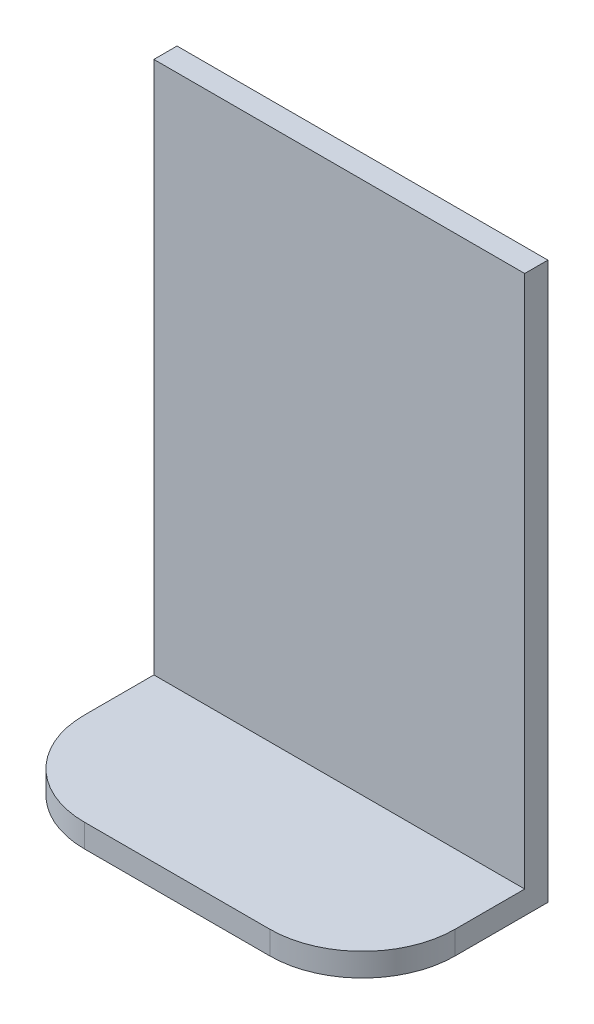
ISO-10303-21;
HEADER;
FILE_DESCRIPTION(('STEP AP214'),'2;1');
FILE_NAME('part.step','',(''),(''),'','','');
FILE_SCHEMA(('AUTOMOTIVE_DESIGN { 1 0 10303 214 1 1 1 1 }'));
ENDSEC;
DATA;
#1=APPLICATION_CONTEXT('core data for automotive mechanical design processes');
#2=APPLICATION_PROTOCOL_DEFINITION('international standard','automotive_design',2000,#1);
#3=PRODUCT_CONTEXT('',#1,'mechanical');
#4=PRODUCT('Part','Part','',(#3));
#5=PRODUCT_RELATED_PRODUCT_CATEGORY('part','',(#4));
#6=PRODUCT_DEFINITION_FORMATION('','',#4);
#7=PRODUCT_DEFINITION_CONTEXT('part definition',#1,'design');
#8=PRODUCT_DEFINITION('design','',#6,#7);
#9=PRODUCT_DEFINITION_SHAPE('','',#8);
#10=(LENGTH_UNIT() NAMED_UNIT(*) SI_UNIT(.MILLI.,.METRE.));
#11=(NAMED_UNIT(*) PLANE_ANGLE_UNIT() SI_UNIT($,.RADIAN.));
#12=(NAMED_UNIT(*) SI_UNIT($,.STERADIAN.) SOLID_ANGLE_UNIT());
#13=UNCERTAINTY_MEASURE_WITH_UNIT(LENGTH_MEASURE(1.E-05),#10,'distance_accuracy_value','');
#14=(GEOMETRIC_REPRESENTATION_CONTEXT(3) GLOBAL_UNCERTAINTY_ASSIGNED_CONTEXT((#13)) GLOBAL_UNIT_ASSIGNED_CONTEXT((#10,
#11,#12)) REPRESENTATION_CONTEXT('',''));
#15=CARTESIAN_POINT('',(0.,0.,0.));
#16=DIRECTION('',(0.,0.,1.));
#17=DIRECTION('',(1.,0.,0.));
#18=AXIS2_PLACEMENT_3D('',#15,#16,#17);
#19=CARTESIAN_POINT('',(25.4,76.2,0.));
#20=DIRECTION('',(0.,0.,1.));
#21=DIRECTION('',(0.,-1.,0.));
#22=AXIS2_PLACEMENT_3D('',#19,#20,#21);
#23=PLANE('',#22);
#24=DIRECTION('',(0.,1.,0.));
#25=VECTOR('',#24,1.);
#26=CARTESIAN_POINT('',(-25.4,76.2,0.));
#27=LINE('',#26,#25);
#28=CARTESIAN_POINT('',(-25.4,0.,0.));
#29=VERTEX_POINT('',#28);
#30=CARTESIAN_POINT('',(-25.4,76.2,0.));
#31=VERTEX_POINT('',#30);
#32=EDGE_CURVE('E128',#29,#31,#27,.T.);
#33=ORIENTED_EDGE('',*,*,#32,.T.);
#34=DIRECTION('',(-1.,0.,0.));
#35=VECTOR('',#34,1.);
#36=CARTESIAN_POINT('',(25.4,76.2,0.));
#37=LINE('',#36,#35);
#38=CARTESIAN_POINT('',(25.4,76.2,0.));
#39=VERTEX_POINT('',#38);
#40=EDGE_CURVE('E107',#39,#31,#37,.T.);
#41=ORIENTED_EDGE('',*,*,#40,.F.);
#42=DIRECTION('',(0.,1.,0.));
#43=VECTOR('',#42,1.);
#44=CARTESIAN_POINT('',(25.4,76.2,0.));
#45=LINE('',#44,#43);
#46=CARTESIAN_POINT('',(25.4,0.,0.));
#47=VERTEX_POINT('',#46);
#48=EDGE_CURVE('E114',#47,#39,#45,.T.);
#49=ORIENTED_EDGE('',*,*,#48,.F.);
#50=DIRECTION('',(-1.,0.,0.));
#51=VECTOR('',#50,1.);
#52=CARTESIAN_POINT('',(25.4,0.,0.));
#53=LINE('',#52,#51);
#54=EDGE_CURVE('E165',#47,#29,#53,.T.);
#55=ORIENTED_EDGE('',*,*,#54,.T.);
#56=EDGE_LOOP('',(#33,#41,#49,#55));
#57=FACE_BOUND('',#56,.T.);
#58=ADVANCED_FACE('F37',(#57),#23,.F.);
#59=CARTESIAN_POINT('',(25.4,76.2,3.17499999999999));
#60=DIRECTION('',(0.,-1.,0.));
#61=DIRECTION('',(0.,0.,-1.));
#62=AXIS2_PLACEMENT_3D('',#59,#60,#61);
#63=PLANE('',#62);
#64=DIRECTION('',(0.,0.,1.));
#65=VECTOR('',#64,1.);
#66=CARTESIAN_POINT('',(-25.4,76.2,3.17499999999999));
#67=LINE('',#66,#65);
#68=CARTESIAN_POINT('',(-25.4,76.2,3.17499999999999));
#69=VERTEX_POINT('',#68);
#70=EDGE_CURVE('E176',#31,#69,#67,.T.);
#71=ORIENTED_EDGE('',*,*,#70,.T.);
#72=DIRECTION('',(-1.,0.,0.));
#73=VECTOR('',#72,1.);
#74=CARTESIAN_POINT('',(25.4,76.2,3.17499999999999));
#75=LINE('',#74,#73);
#76=CARTESIAN_POINT('',(25.4,76.2,3.17499999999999));
#77=VERTEX_POINT('',#76);
#78=EDGE_CURVE('E110',#77,#69,#75,.T.);
#79=ORIENTED_EDGE('',*,*,#78,.F.);
#80=DIRECTION('',(0.,0.,1.));
#81=VECTOR('',#80,1.);
#82=CARTESIAN_POINT('',(25.4,76.2,3.17499999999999));
#83=LINE('',#82,#81);
#84=EDGE_CURVE('E103',#39,#77,#83,.T.);
#85=ORIENTED_EDGE('',*,*,#84,.F.);
#86=ORIENTED_EDGE('',*,*,#40,.T.);
#87=EDGE_LOOP('',(#71,#79,#85,#86));
#88=FACE_BOUND('',#87,.T.);
#89=ADVANCED_FACE('F105',(#88),#63,.F.);
#90=CARTESIAN_POINT('',(25.4,3.175,3.17499999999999));
#91=DIRECTION('',(0.,0.,-1.));
#92=DIRECTION('',(0.,1.,0.));
#93=AXIS2_PLACEMENT_3D('',#90,#91,#92);
#94=PLANE('',#93);
#95=DIRECTION('',(0.,-1.,0.));
#96=VECTOR('',#95,1.);
#97=CARTESIAN_POINT('',(-25.4,3.175,3.17499999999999));
#98=LINE('',#97,#96);
#99=CARTESIAN_POINT('',(-25.4,3.175,3.17499999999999));
#100=VERTEX_POINT('',#99);
#101=EDGE_CURVE('E174',#69,#100,#98,.T.);
#102=ORIENTED_EDGE('',*,*,#101,.T.);
#103=DIRECTION('',(-1.,0.,0.));
#104=VECTOR('',#103,1.);
#105=CARTESIAN_POINT('',(25.4,3.175,3.17499999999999));
#106=LINE('',#105,#104);
#107=CARTESIAN_POINT('',(25.4,3.175,3.17499999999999));
#108=VERTEX_POINT('',#107);
#109=EDGE_CURVE('E133',#108,#100,#106,.T.);
#110=ORIENTED_EDGE('',*,*,#109,.F.);
#111=DIRECTION('',(0.,-1.,0.));
#112=VECTOR('',#111,1.);
#113=CARTESIAN_POINT('',(25.4,3.175,3.17499999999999));
#114=LINE('',#113,#112);
#115=EDGE_CURVE('E113',#77,#108,#114,.T.);
#116=ORIENTED_EDGE('',*,*,#115,.F.);
#117=ORIENTED_EDGE('',*,*,#78,.T.);
#118=EDGE_LOOP('',(#102,#110,#116,#117));
#119=FACE_BOUND('',#118,.T.);
#120=ADVANCED_FACE('F182',(#119),#94,.F.);
#121=CARTESIAN_POINT('',(25.4,3.175,25.4));
#122=DIRECTION('',(0.,-1.,0.));
#123=DIRECTION('',(0.,0.,-1.));
#124=AXIS2_PLACEMENT_3D('',#121,#122,#123);
#125=PLANE('',#124);
#126=DIRECTION('',(-1.,0.,0.));
#127=VECTOR('',#126,1.);
#128=CARTESIAN_POINT('',(25.4,3.175,25.4));
#129=LINE('',#128,#127);
#130=CARTESIAN_POINT('',(12.7,3.175,25.4));
#131=VERTEX_POINT('',#130);
#132=CARTESIAN_POINT('',(-12.7,3.175,25.4));
#133=VERTEX_POINT('',#132);
#134=EDGE_CURVE('E150',#131,#133,#129,.T.);
#135=ORIENTED_EDGE('',*,*,#134,.F.);
#136=CARTESIAN_POINT('',(12.7,3.175,12.7));
#137=DIRECTION('',(0.,-1.,0.));
#138=DIRECTION('',(0.,0.,-1.));
#139=AXIS2_PLACEMENT_3D('',#136,#137,#138);
#140=CIRCLE('',#139,12.7);
#141=CARTESIAN_POINT('',(25.4,3.175,12.7));
#142=VERTEX_POINT('',#141);
#143=EDGE_CURVE('E45',#131,#142,#140,.F.);
#144=ORIENTED_EDGE('',*,*,#143,.T.);
#145=DIRECTION('',(0.,0.,1.));
#146=VECTOR('',#145,1.);
#147=CARTESIAN_POINT('',(25.4,3.175,25.4));
#148=LINE('',#147,#146);
#149=EDGE_CURVE('E149',#108,#142,#148,.T.);
#150=ORIENTED_EDGE('',*,*,#149,.F.);
#151=ORIENTED_EDGE('',*,*,#109,.T.);
#152=DIRECTION('',(0.,0.,1.));
#153=VECTOR('',#152,1.);
#154=CARTESIAN_POINT('',(-25.4,3.175,25.4));
#155=LINE('',#154,#153);
#156=CARTESIAN_POINT('',(-25.4,3.175,12.7));
#157=VERTEX_POINT('',#156);
#158=EDGE_CURVE('E170',#100,#157,#155,.T.);
#159=ORIENTED_EDGE('',*,*,#158,.T.);
#160=CARTESIAN_POINT('',(-12.7,3.175,12.7));
#161=DIRECTION('',(0.,-1.,0.));
#162=DIRECTION('',(0.,0.,-1.));
#163=AXIS2_PLACEMENT_3D('',#160,#161,#162);
#164=CIRCLE('',#163,12.7);
#165=EDGE_CURVE('E57',#157,#133,#164,.F.);
#166=ORIENTED_EDGE('',*,*,#165,.T.);
#167=EDGE_LOOP('',(#135,#144,#150,#151,#159,#166));
#168=FACE_BOUND('',#167,.T.);
#169=ADVANCED_FACE('F147',(#168),#125,.F.);
#170=CARTESIAN_POINT('',(25.4,0.,25.4));
#171=DIRECTION('',(0.,0.,-1.));
#172=DIRECTION('',(-1.,0.,0.));
#173=AXIS2_PLACEMENT_3D('',#170,#171,#172);
#174=PLANE('',#173);
#175=DIRECTION('',(-1.,0.,0.));
#176=VECTOR('',#175,1.);
#177=CARTESIAN_POINT('',(25.4,0.,25.4));
#178=LINE('',#177,#176);
#179=CARTESIAN_POINT('',(12.7,0.,25.4));
#180=VERTEX_POINT('',#179);
#181=CARTESIAN_POINT('',(-12.7,0.,25.4));
#182=VERTEX_POINT('',#181);
#183=EDGE_CURVE('E161',#180,#182,#178,.T.);
#184=ORIENTED_EDGE('',*,*,#183,.F.);
#185=DIRECTION('',(0.,-1.,0.));
#186=VECTOR('',#185,1.);
#187=CARTESIAN_POINT('',(12.7,0.,25.4));
#188=LINE('',#187,#186);
#189=EDGE_CURVE('E143',#180,#131,#188,.F.);
#190=ORIENTED_EDGE('',*,*,#189,.T.);
#191=ORIENTED_EDGE('',*,*,#134,.T.);
#192=DIRECTION('',(0.,-1.,0.));
#193=VECTOR('',#192,1.);
#194=CARTESIAN_POINT('',(-12.7,0.,25.4));
#195=LINE('',#194,#193);
#196=EDGE_CURVE('E140',#133,#182,#195,.T.);
#197=ORIENTED_EDGE('',*,*,#196,.T.);
#198=EDGE_LOOP('',(#184,#190,#191,#197));
#199=FACE_BOUND('',#198,.T.);
#200=ADVANCED_FACE('F163',(#199),#174,.F.);
#201=CARTESIAN_POINT('',(25.4,0.,0.));
#202=DIRECTION('',(0.,1.,0.));
#203=DIRECTION('',(0.,0.,1.));
#204=AXIS2_PLACEMENT_3D('',#201,#202,#203);
#205=PLANE('',#204);
#206=DIRECTION('',(0.,0.,-1.));
#207=VECTOR('',#206,1.);
#208=CARTESIAN_POINT('',(25.4,0.,0.));
#209=LINE('',#208,#207);
#210=CARTESIAN_POINT('',(25.4,0.,12.7));
#211=VERTEX_POINT('',#210);
#212=EDGE_CURVE('E121',#211,#47,#209,.T.);
#213=ORIENTED_EDGE('',*,*,#212,.F.);
#214=CARTESIAN_POINT('',(12.7,0.,12.7));
#215=DIRECTION('',(0.,1.,0.));
#216=DIRECTION('',(0.,0.,1.));
#217=AXIS2_PLACEMENT_3D('',#214,#215,#216);
#218=CIRCLE('',#217,12.7);
#219=EDGE_CURVE('E138',#211,#180,#218,.F.);
#220=ORIENTED_EDGE('',*,*,#219,.T.);
#221=ORIENTED_EDGE('',*,*,#183,.T.);
#222=CARTESIAN_POINT('',(-12.7,0.,12.7));
#223=DIRECTION('',(0.,1.,0.));
#224=DIRECTION('',(0.,0.,1.));
#225=AXIS2_PLACEMENT_3D('',#222,#223,#224);
#226=CIRCLE('',#225,12.7);
#227=CARTESIAN_POINT('',(-25.4,0.,12.7));
#228=VERTEX_POINT('',#227);
#229=EDGE_CURVE('E131',#182,#228,#226,.F.);
#230=ORIENTED_EDGE('',*,*,#229,.T.);
#231=DIRECTION('',(0.,0.,-1.));
#232=VECTOR('',#231,1.);
#233=CARTESIAN_POINT('',(-25.4,0.,0.));
#234=LINE('',#233,#232);
#235=EDGE_CURVE('E125',#228,#29,#234,.T.);
#236=ORIENTED_EDGE('',*,*,#235,.T.);
#237=ORIENTED_EDGE('',*,*,#54,.F.);
#238=EDGE_LOOP('',(#213,#220,#221,#230,#236,#237));
#239=FACE_BOUND('',#238,.T.);
#240=ADVANCED_FACE('F160',(#239),#205,.F.);
#241=CARTESIAN_POINT('',(25.4,0.,0.));
#242=DIRECTION('',(-1.,0.,0.));
#243=DIRECTION('',(0.,0.,1.));
#244=AXIS2_PLACEMENT_3D('',#241,#242,#243);
#245=PLANE('',#244);
#246=ORIENTED_EDGE('',*,*,#149,.T.);
#247=DIRECTION('',(0.,-1.,0.));
#248=VECTOR('',#247,1.);
#249=CARTESIAN_POINT('',(25.4,0.,12.7));
#250=LINE('',#249,#248);
#251=EDGE_CURVE('E129',#142,#211,#250,.T.);
#252=ORIENTED_EDGE('',*,*,#251,.T.);
#253=ORIENTED_EDGE('',*,*,#212,.T.);
#254=ORIENTED_EDGE('',*,*,#48,.T.);
#255=ORIENTED_EDGE('',*,*,#84,.T.);
#256=ORIENTED_EDGE('',*,*,#115,.T.);
#257=EDGE_LOOP('',(#246,#252,#253,#254,#255,#256));
#258=FACE_BOUND('',#257,.T.);
#259=ADVANCED_FACE('F118',(#258),#245,.F.);
#260=CARTESIAN_POINT('',(-25.4,0.,0.));
#261=DIRECTION('',(-1.,0.,0.));
#262=DIRECTION('',(0.,0.,1.));
#263=AXIS2_PLACEMENT_3D('',#260,#261,#262);
#264=PLANE('',#263);
#265=ORIENTED_EDGE('',*,*,#235,.F.);
#266=DIRECTION('',(0.,-1.,0.));
#267=VECTOR('',#266,1.);
#268=CARTESIAN_POINT('',(-25.4,3.175,12.7));
#269=LINE('',#268,#267);
#270=EDGE_CURVE('E11',#228,#157,#269,.F.);
#271=ORIENTED_EDGE('',*,*,#270,.T.);
#272=ORIENTED_EDGE('',*,*,#158,.F.);
#273=ORIENTED_EDGE('',*,*,#101,.F.);
#274=ORIENTED_EDGE('',*,*,#70,.F.);
#275=ORIENTED_EDGE('',*,*,#32,.F.);
#276=EDGE_LOOP('',(#265,#271,#272,#273,#274,#275));
#277=FACE_BOUND('',#276,.T.);
#278=ADVANCED_FACE('F173',(#277),#264,.T.);
#279=CARTESIAN_POINT('',(12.7,0.,12.7));
#280=DIRECTION('',(0.,-1.,0.));
#281=DIRECTION('',(0.,0.,-1.));
#282=AXIS2_PLACEMENT_3D('',#279,#280,#281);
#283=CYLINDRICAL_SURFACE('',#282,12.7);
#284=ORIENTED_EDGE('',*,*,#143,.F.);
#285=ORIENTED_EDGE('',*,*,#189,.F.);
#286=ORIENTED_EDGE('',*,*,#219,.F.);
#287=ORIENTED_EDGE('',*,*,#251,.F.);
#288=EDGE_LOOP('',(#284,#285,#286,#287));
#289=FACE_BOUND('',#288,.T.);
#290=ADVANCED_FACE('F156',(#289),#283,.T.);
#291=CARTESIAN_POINT('',(-12.7,0.,12.7));
#292=DIRECTION('',(0.,1.,0.));
#293=DIRECTION('',(0.,0.,1.));
#294=AXIS2_PLACEMENT_3D('',#291,#292,#293);
#295=CYLINDRICAL_SURFACE('',#294,12.7);
#296=ORIENTED_EDGE('',*,*,#165,.F.);
#297=ORIENTED_EDGE('',*,*,#270,.F.);
#298=ORIENTED_EDGE('',*,*,#229,.F.);
#299=ORIENTED_EDGE('',*,*,#196,.F.);
#300=EDGE_LOOP('',(#296,#297,#298,#299));
#301=FACE_BOUND('',#300,.T.);
#302=ADVANCED_FACE('F39',(#301),#295,.T.);
#303=CLOSED_SHELL('',(#58,#89,#120,#169,#200,#240,#259,#278,#290,#302));
#304=MANIFOLD_SOLID_BREP('B2',#303);
#305=ADVANCED_BREP_SHAPE_REPRESENTATION('',(#18,#304),#14);
#306=SHAPE_DEFINITION_REPRESENTATION(#9,#305);
ENDSEC;
END-ISO-10303-21;
